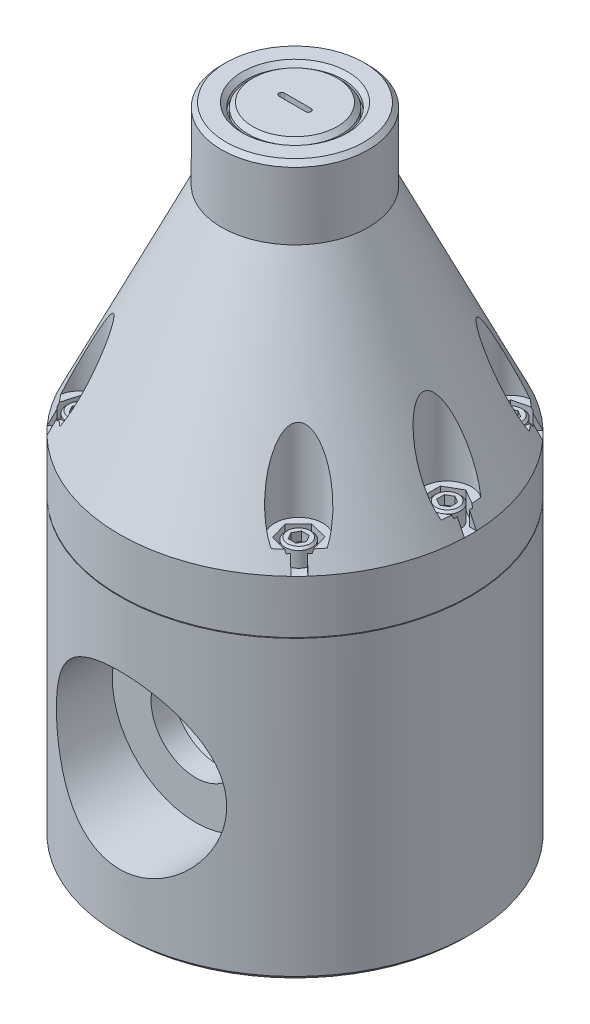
from build123d import *

# Parameters (mm, degrees)
SKETCH1_R                = 62.23
EXTRUDE1_DEPTH           = 226.06
SKETCH3_R                = 8.5725
EXTRUDE2_DEPTH           = 50.8
EXTRUDE3_DEPTH           = 6.223
SKETCH5_W                = 7.654715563
SKETCH5_H                = 4.2672
EXTRUDE4_DEPTH           = 6.223
SKETCH6_R                = 4.7625
EXTRUDE6_DEPTH           = 6.223
EXTRUDE7_DEPTH           = 3.175
CHAMFER1_SIZE            = 0.762
CHAMFER1_OF_MIRROR1_SIZE = 0.762
SKETCH8_R                = 17.145
EXTRUDE8_DEPTH           = 3.175
SKETCH9_R                = 16.51
EXTRUDE9_DEPTH           = 3.175
EXTRUDE10_DEPTH          = 3.175
CHAMFER2_SIZE            = 1.5748
CHAMFER3_SIZE            = 1.5748
CHAMFER4_SIZE            = 1.5748


with BuildPart() as part:
    # Sketch1 → Extrude1 (new body)
    with BuildSketch(Plane(origin=(0, 0, 0), x_dir=(1, 0, 0), z_dir=(0, 1, 0))):
        with Locations(Location((0, 0, 0), (0, 0, 90))):
            Circle(SKETCH1_R)
    extrude(amount=EXTRUDE1_DEPTH)

    # Sketch2 → Cut-Revolve1 (revolve, cut)
    with BuildSketch(Plane.XY, mode=Mode.PRIVATE) as cut_revolve1_sk:
        Polygon((-67.536130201, 105.41), (-45.085, 105.41), (-45.085, 105.664), (-62.23, 105.664), (-62.23, 124.46), (-26.035, 200.66), (-26.035, 228.6), (-77.461567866, 228.6), (-77.461567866, 105.41), align=None)
    revolve(cut_revolve1_sk.sketch.rotate(Axis((0, 0, 0), (0, 1, 0)), 180), axis=Axis((0, 0, 0), (0, 1, 0)), mode=Mode.SUBTRACT)

    # Sketch3 → Extrude2 (cut)
    with BuildSketch(Plane(origin=(0, 130.683, 0), x_dir=(-1, 0, 0), z_dir=(0, 1, 0))):
        with Locations((-38.826365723, 37.494185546)):
            Circle(SKETCH3_R)
        with Locations((-53.975, 0)):
            Circle(SKETCH3_R)
        with Locations((-38.826365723, -37.494185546)):
            Circle(SKETCH3_R)
    extrude2 = extrude(amount=EXTRUDE2_DEPTH, mode=Mode.SUBTRACT)

    # Sketch4 → Extrude3 (cut)
    with BuildSketch(Plane(origin=(0, 130.683, 0), x_dir=(-1, 0, 0), z_dir=(0, 1, 0))):
        Polygon((-43.410495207, 32.747180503), (-37.007403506, 31.150710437), (-32.423274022, 35.89771548), (-34.24223624, 42.241190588), (-40.64532794, 43.837660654), (-45.229457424, 39.090655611), align=None)
        Polygon((-53.975, 6.599113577), (-59.69, 3.299556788), (-59.69, -3.299556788), (-53.975, -6.599113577), (-48.26, -3.299556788), (-48.26, 3.299556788), align=None)
        Polygon((-43.410495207, -32.747180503), (-45.229457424, -39.090655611), (-40.64532794, -43.837660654), (-34.24223624, -42.241190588), (-32.423274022, -35.89771548), (-37.007403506, -31.150710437), align=None)
    extrude3 = extrude(amount=-EXTRUDE3_DEPTH, mode=Mode.SUBTRACT)

    # Sketch5 → Extrude4 (cut)
    with BuildSketch(Plane(origin=(0, 130.683, 0), x_dir=(-1, 0, 0), z_dir=(0, 1, 0))):
        Polygon((-39.947895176, 41.543286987), (-44.67273389, 46.106010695), (-47.49211039, 42.896544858), (-43.148780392, 38.702239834), align=None)
        with Locations((-60.345020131, 0)):
            Rectangle(SKETCH5_W, SKETCH5_H)
        Polygon((-41.449258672, -37.061030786), (-47.658063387, -43.056803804), (-44.752470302, -46.183011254), (-38.871838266, -40.504150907), align=None)
    extrude4 = extrude(amount=-EXTRUDE4_DEPTH, mode=Mode.SUBTRACT)

    # Sketch6 → Extrude6 (add)
    with BuildSketch(Plane(origin=(0, 130.683, 0), x_dir=(-1, 0, 0), z_dir=(0, 1, 0))):
        with Locations(Location((-38.826365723, 37.494185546, 0), (0, 0, 90))):
            Circle(SKETCH6_R)
        with Locations(Location((-53.975, 0, 0), (0, 0, 90))):
            Circle(SKETCH6_R)
        with Locations(Location((-38.826365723, -37.494185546, 0), (0, 0, 90))):
            Circle(SKETCH6_R)
    extrude6 = extrude(amount=-EXTRUDE6_DEPTH)

    # Sketch7 → Extrude7 (cut)
    with BuildSketch(Plane(origin=(0, 130.683, 0), x_dir=(-1, 0, 0), z_dir=(0, 1, 0))):
        Polygon((-41.568664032, 37.494185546), (-40.197514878, 35.119285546), (-37.455216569, 35.119285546), (-36.084067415, 37.494185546), (-37.455216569, 39.869085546), (-40.197514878, 39.869085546), align=None)
        Polygon((-53.975, 2.742298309), (-56.3499, 1.371149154), (-56.3499, -1.371149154), (-53.975, -2.742298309), (-51.6001, -1.371149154), (-51.6001, 1.371149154), align=None)
        Polygon((-38.826365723, -34.751887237), (-41.201265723, -36.123036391), (-41.201265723, -38.8653347), (-38.826365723, -40.236483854), (-36.451465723, -38.8653347), (-36.451465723, -36.123036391), align=None)
    extrude7 = extrude(amount=-EXTRUDE7_DEPTH, mode=Mode.SUBTRACT)

    # Chamfer1
    chamfer1_edges = [part.edges().sort_by_distance(p)[0] for p in [
        (38.826365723, 130.683, 32.731685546),
        (53.975, 130.683, -4.7625),
        (38.826365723, 130.683, -42.256685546),
    ]]
    chamfer(chamfer1_edges, length=CHAMFER1_SIZE)

    # Mirror1: Extrude2, Extrude3, Extrude4, Extrude6, Extrude7 across plane
    add(extrude2.mirror(Plane(origin=(0, 0, 0), x_dir=(0, 0, 1), z_dir=(1, 0, 0))), mode=Mode.SUBTRACT)
    add(extrude3.mirror(Plane(origin=(0, 0, 0), x_dir=(0, 0, 1), z_dir=(1, 0, 0))), mode=Mode.SUBTRACT)
    add(extrude4.mirror(Plane(origin=(0, 0, 0), x_dir=(0, 0, 1), z_dir=(1, 0, 0))), mode=Mode.SUBTRACT)
    add(extrude6.mirror(Plane(origin=(0, 0, 0), x_dir=(0, 0, 1), z_dir=(1, 0, 0))))
    add(extrude7.mirror(Plane(origin=(0, 0, 0), x_dir=(0, 0, 1), z_dir=(1, 0, 0))), mode=Mode.SUBTRACT)

    # Chamfer1 of Mirror1
    chamfer1_of_mirror1_edges = [part.edges().sort_by_distance(p)[0] for p in [
        (-38.826365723, 130.683, 32.731685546),
        (-53.975, 130.683, -4.7625),
        (-38.826365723, 130.683, -42.256685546),
    ]]
    chamfer(chamfer1_of_mirror1_edges, length=CHAMFER1_OF_MIRROR1_SIZE)

    # Sketch8 → Extrude8 (cut)
    with BuildSketch(Plane(origin=(0, 226.06, 0), x_dir=(-1, 0, 0), z_dir=(0, 1, 0))):
        with Locations(Location((0, 0, 0), (0, 0, 90))):
            Circle(SKETCH8_R)
    extrude(amount=-EXTRUDE8_DEPTH, mode=Mode.SUBTRACT)

    # Sketch9 → Extrude9 (add)
    with BuildSketch(Plane(origin=(0, 226.06, 0), x_dir=(-1, 0, 0), z_dir=(0, 1, 0))):
        with Locations(Location((0, 0, 0), (0, 0, 90))):
            Circle(SKETCH9_R)
    extrude(amount=-EXTRUDE9_DEPTH)

    # Sketch10 → Extrude10 (cut)
    with BuildSketch(Plane(origin=(0, 226.06, 0), x_dir=(-1, 0, 0), z_dir=(0, 1, 0))):
        with BuildLine():
            Line((-4.7625, 0.9652), (4.7625, 0.9652))
            ThreePointArc((4.7625, 0.9652), (5.7277, 0), (4.7625, -0.9652))
            Line((4.7625, -0.9652), (-4.7625, -0.9652))
            ThreePointArc((-4.7625, -0.9652), (-5.7277, 0), (-4.7625, 0.9652))
        make_face()
    extrude(amount=-EXTRUDE10_DEPTH, mode=Mode.SUBTRACT)

    # Chamfer2
    chamfer2_edges = [part.edges().sort_by_distance(p)[0] for p in [
        (0, 226.06, -17.145),
        (-26.035, 226.06, 0),
    ]]
    chamfer(chamfer2_edges, length=CHAMFER2_SIZE)

    # Chamfer3
    chamfer3_edges = [part.edges().sort_by_distance(p)[0] for p in [
        (0, 226.06, -16.51),
    ]]
    chamfer(chamfer3_edges, length=CHAMFER3_SIZE)

    # Chamfer4
    chamfer4_edges = [part.edges().sort_by_distance(p)[0] for p in [
        (0, 0, 62.23),
    ]]
    chamfer(chamfer4_edges, length=CHAMFER4_SIZE)

    # Sketch13 → 2 NPT Tapped Hole2 (revolve, cut)
    with BuildSketch(Plane(origin=(0, 52.07, 62.23), x_dir=(0, -1, 0), z_dir=(1, 0, 0))):
        Polygon((0, 0), (0, 44.463662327), (15.875, 34.925), (15.875, 27.051), (29.632502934, 27.051), (30.4424461, 0), align=None)
    f_2_npt_tapped_hole2 = revolve(axis=Axis((0, 52.07, 68.58), (0, 0, -1)), mode=Mode.SUBTRACT)

    # Mirror2: 2 NPT Tapped Hole2 across plane
    add(f_2_npt_tapped_hole2.mirror(Plane.XY), mode=Mode.SUBTRACT)


solid = part.part
